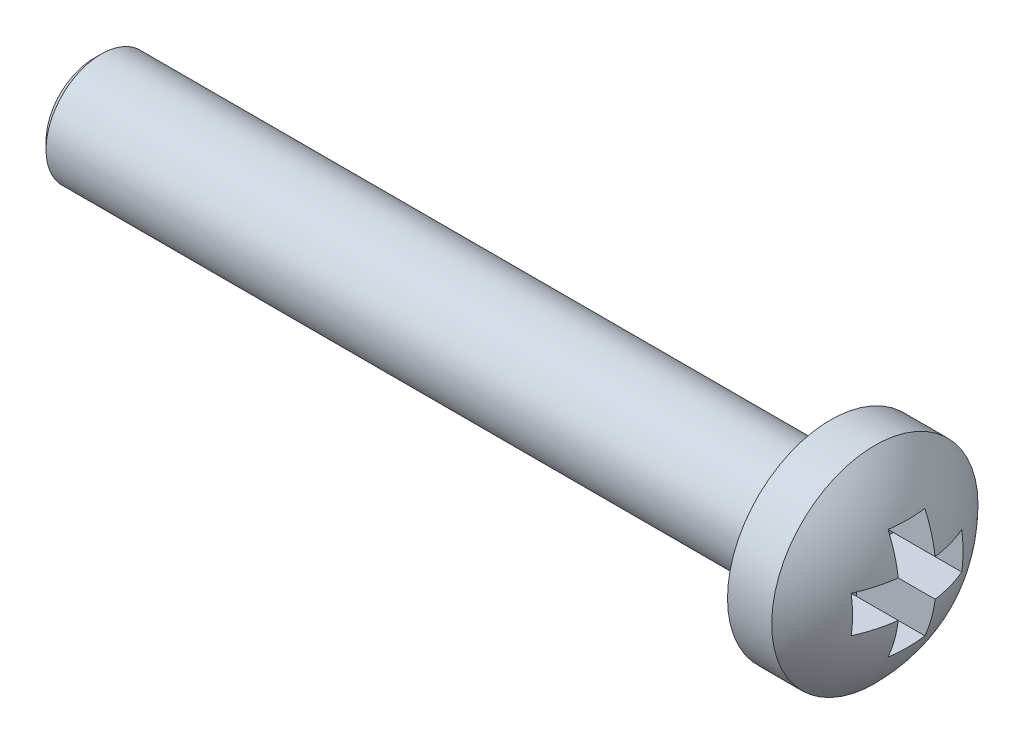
from build123d import *

# Parameters (mm, degrees)
CHANFREIN1_SIZE         = 0.2
ENL_V_START             = -2.4
ENL_V_MAT_EXTRU_1_DEPTH = 2.2


with BuildPart() as part:
    # Esquisse1 → R_volution1 (revolve)
    with BuildSketch(Plane.XY, mode=Mode.PRIVATE) as r_volution1_sk:
        with BuildLine():
            Line((0, 1.5), (0, 2.8))
            Line((0, 2.8), (1.2, 2.8))
            add(Edge.make_bspline(
                [(1.2, 2.8), (2.4, 1.571691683), (2.4, 0)],
                knots=[0, 0, 0, 1, 1, 1], degree=2))
            Line((2.4, 0), (-20, 0))
            Line((-20, 0), (-20, 1.5))
            Line((-20, 1.5), (0, 1.5))
        make_face()
    revolve(r_volution1_sk.sketch.rotate(Axis((11.061826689, 0, 0), (-1, 0, 0)), 90), axis=Axis((11.061826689, 0, 0), (-1, 0, 0)))

    # Chanfrein1
    chanfrein1_edges = [part.edges().sort_by_distance(p)[0] for p in [
        (-20, 0, 1.5),
    ]]
    chamfer(chanfrein1_edges, length=CHANFREIN1_SIZE)

    # Esquisse2 → Enl_v. mat.-Extru.1 (cut)
    with BuildSketch(Plane.ZY.offset(ENL_V_START)):
        Polygon((-0.5, 0.5), (-1.5, 0.5), (-1.5, -0.5), (-0.5, -0.5), (-0.5, -1.5), (0.5, -1.5), (0.5, -0.5), (1.5, -0.5), (1.5, 0.5), (0.5, 0.5), (0.5, 1.5), (-0.5, 1.5), align=None)
    extrude(amount=ENL_V_MAT_EXTRU_1_DEPTH, mode=Mode.SUBTRACT)


solid = part.part
